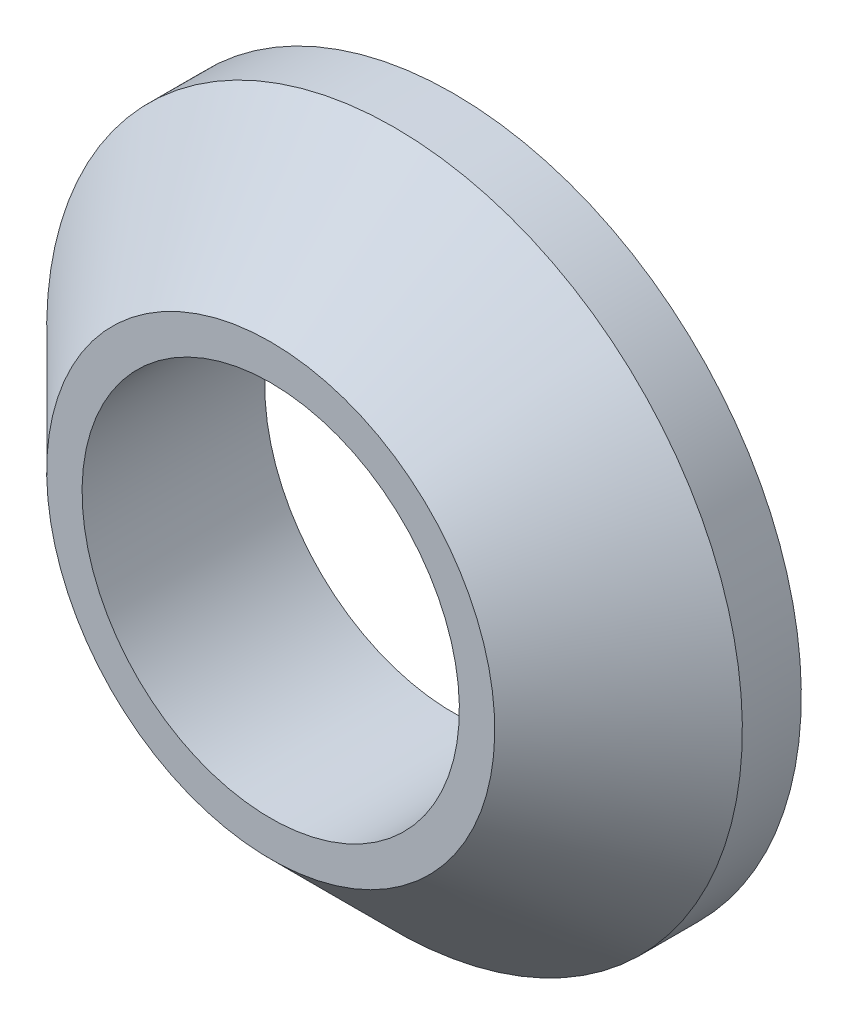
ISO-10303-21;
HEADER;
FILE_DESCRIPTION(('STEP AP214'),'2;1');
FILE_NAME('part.step','',(''),(''),'','','');
FILE_SCHEMA(('AUTOMOTIVE_DESIGN { 1 0 10303 214 1 1 1 1 }'));
ENDSEC;
DATA;
#1=APPLICATION_CONTEXT('core data for automotive mechanical design processes');
#2=APPLICATION_PROTOCOL_DEFINITION('international standard','automotive_design',2000,#1);
#3=PRODUCT_CONTEXT('',#1,'mechanical');
#4=PRODUCT('Part','Part','',(#3));
#5=PRODUCT_RELATED_PRODUCT_CATEGORY('part','',(#4));
#6=PRODUCT_DEFINITION_FORMATION('','',#4);
#7=PRODUCT_DEFINITION_CONTEXT('part definition',#1,'design');
#8=PRODUCT_DEFINITION('design','',#6,#7);
#9=PRODUCT_DEFINITION_SHAPE('','',#8);
#10=(LENGTH_UNIT() NAMED_UNIT(*) SI_UNIT(.MILLI.,.METRE.));
#11=(NAMED_UNIT(*) PLANE_ANGLE_UNIT() SI_UNIT($,.RADIAN.));
#12=(NAMED_UNIT(*) SI_UNIT($,.STERADIAN.) SOLID_ANGLE_UNIT());
#13=UNCERTAINTY_MEASURE_WITH_UNIT(LENGTH_MEASURE(1.E-05),#10,'distance_accuracy_value','');
#14=(GEOMETRIC_REPRESENTATION_CONTEXT(3) GLOBAL_UNCERTAINTY_ASSIGNED_CONTEXT((#13)) GLOBAL_UNIT_ASSIGNED_CONTEXT((#10,
#11,#12)) REPRESENTATION_CONTEXT('',''));
#15=CARTESIAN_POINT('',(0.,0.,0.));
#16=DIRECTION('',(0.,0.,1.));
#17=DIRECTION('',(1.,0.,0.));
#18=AXIS2_PLACEMENT_3D('',#15,#16,#17);
#19=CARTESIAN_POINT('',(5.9,0.,0.));
#20=DIRECTION('',(0.,0.,-1.));
#21=DIRECTION('',(0.,1.,0.));
#22=AXIS2_PLACEMENT_3D('',#19,#20,#21);
#23=PLANE('',#22);
#24=CARTESIAN_POINT('',(0.,0.,0.));
#25=DIRECTION('',(0.,0.,-1.));
#26=DIRECTION('',(0.,1.,0.));
#27=AXIS2_PLACEMENT_3D('',#24,#25,#26);
#28=CIRCLE('',#27,5.9);
#29=CARTESIAN_POINT('',(0.,5.9,0.));
#30=VERTEX_POINT('',#29);
#31=EDGE_CURVE('E31',#30,#30,#28,.T.);
#32=ORIENTED_EDGE('',*,*,#31,.T.);
#33=EDGE_LOOP('',(#32));
#34=FACE_BOUND('',#33,.T.);
#35=CARTESIAN_POINT('',(0.,0.,0.));
#36=DIRECTION('',(0.,0.,-1.));
#37=DIRECTION('',(0.,1.,0.));
#38=AXIS2_PLACEMENT_3D('',#35,#36,#37);
#39=CIRCLE('',#38,3.2);
#40=CARTESIAN_POINT('',(0.,3.2,0.));
#41=VERTEX_POINT('',#40);
#42=EDGE_CURVE('E8',#41,#41,#39,.T.);
#43=ORIENTED_EDGE('',*,*,#42,.F.);
#44=EDGE_LOOP('',(#43));
#45=FACE_BOUND('',#44,.T.);
#46=ADVANCED_FACE('F12',(#34,#45),#23,.T.);
#47=CARTESIAN_POINT('',(0.,0.,0.));
#48=DIRECTION('',(0.,0.,-1.));
#49=DIRECTION('',(0.,1.,0.));
#50=AXIS2_PLACEMENT_3D('',#47,#48,#49);
#51=CYLINDRICAL_SURFACE('',#50,3.2);
#52=ORIENTED_EDGE('',*,*,#42,.T.);
#53=EDGE_LOOP('',(#52));
#54=FACE_BOUND('',#53,.T.);
#55=CARTESIAN_POINT('',(0.,0.,3.1));
#56=DIRECTION('',(0.,0.,-1.));
#57=DIRECTION('',(0.,1.,0.));
#58=AXIS2_PLACEMENT_3D('',#55,#56,#57);
#59=CIRCLE('',#58,3.2);
#60=CARTESIAN_POINT('',(0.,3.2,3.1));
#61=VERTEX_POINT('',#60);
#62=EDGE_CURVE('E18',#61,#61,#59,.T.);
#63=ORIENTED_EDGE('',*,*,#62,.F.);
#64=EDGE_LOOP('',(#63));
#65=FACE_BOUND('',#64,.T.);
#66=ADVANCED_FACE('F51',(#54,#65),#51,.F.);
#67=CARTESIAN_POINT('',(3.2,0.,3.1));
#68=DIRECTION('',(0.,0.,1.));
#69=DIRECTION('',(0.,-1.,0.));
#70=AXIS2_PLACEMENT_3D('',#67,#68,#69);
#71=PLANE('',#70);
#72=ORIENTED_EDGE('',*,*,#62,.T.);
#73=EDGE_LOOP('',(#72));
#74=FACE_BOUND('',#73,.T.);
#75=CARTESIAN_POINT('',(0.,0.,3.1));
#76=DIRECTION('',(0.,0.,-1.));
#77=DIRECTION('',(0.,1.,0.));
#78=AXIS2_PLACEMENT_3D('',#75,#76,#77);
#79=CIRCLE('',#78,3.8);
#80=CARTESIAN_POINT('',(0.,3.8,3.1));
#81=VERTEX_POINT('',#80);
#82=EDGE_CURVE('E22',#81,#81,#79,.T.);
#83=ORIENTED_EDGE('',*,*,#82,.F.);
#84=EDGE_LOOP('',(#83));
#85=FACE_BOUND('',#84,.T.);
#86=ADVANCED_FACE('F47',(#74,#85),#71,.T.);
#87=CARTESIAN_POINT('',(0.,0.,1.));
#88=DIRECTION('',(0.,0.,-1.));
#89=DIRECTION('',(0.,1.,0.));
#90=AXIS2_PLACEMENT_3D('',#87,#88,#89);
#91=CONICAL_SURFACE('',#90,5.9,0.785398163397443);
#92=ORIENTED_EDGE('',*,*,#82,.T.);
#93=EDGE_LOOP('',(#92));
#94=FACE_BOUND('',#93,.T.);
#95=CARTESIAN_POINT('',(0.,0.,1.));
#96=DIRECTION('',(0.,0.,-1.));
#97=DIRECTION('',(0.,1.,0.));
#98=AXIS2_PLACEMENT_3D('',#95,#96,#97);
#99=CIRCLE('',#98,5.9);
#100=CARTESIAN_POINT('',(0.,5.9,1.));
#101=VERTEX_POINT('',#100);
#102=EDGE_CURVE('E26',#101,#101,#99,.T.);
#103=ORIENTED_EDGE('',*,*,#102,.F.);
#104=EDGE_LOOP('',(#103));
#105=FACE_BOUND('',#104,.T.);
#106=ADVANCED_FACE('F39',(#94,#105),#91,.T.);
#107=CARTESIAN_POINT('',(0.,0.,0.));
#108=DIRECTION('',(0.,0.,-1.));
#109=DIRECTION('',(0.,1.,0.));
#110=AXIS2_PLACEMENT_3D('',#107,#108,#109);
#111=CYLINDRICAL_SURFACE('',#110,5.9);
#112=ORIENTED_EDGE('',*,*,#102,.T.);
#113=EDGE_LOOP('',(#112));
#114=FACE_BOUND('',#113,.T.);
#115=ORIENTED_EDGE('',*,*,#31,.F.);
#116=EDGE_LOOP('',(#115));
#117=FACE_BOUND('',#116,.T.);
#118=ADVANCED_FACE('F37',(#114,#117),#111,.T.);
#119=CLOSED_SHELL('',(#46,#66,#86,#106,#118));
#120=MANIFOLD_SOLID_BREP('B1',#119);
#121=ADVANCED_BREP_SHAPE_REPRESENTATION('',(#18,#120),#14);
#122=SHAPE_DEFINITION_REPRESENTATION(#9,#121);
ENDSEC;
END-ISO-10303-21;
